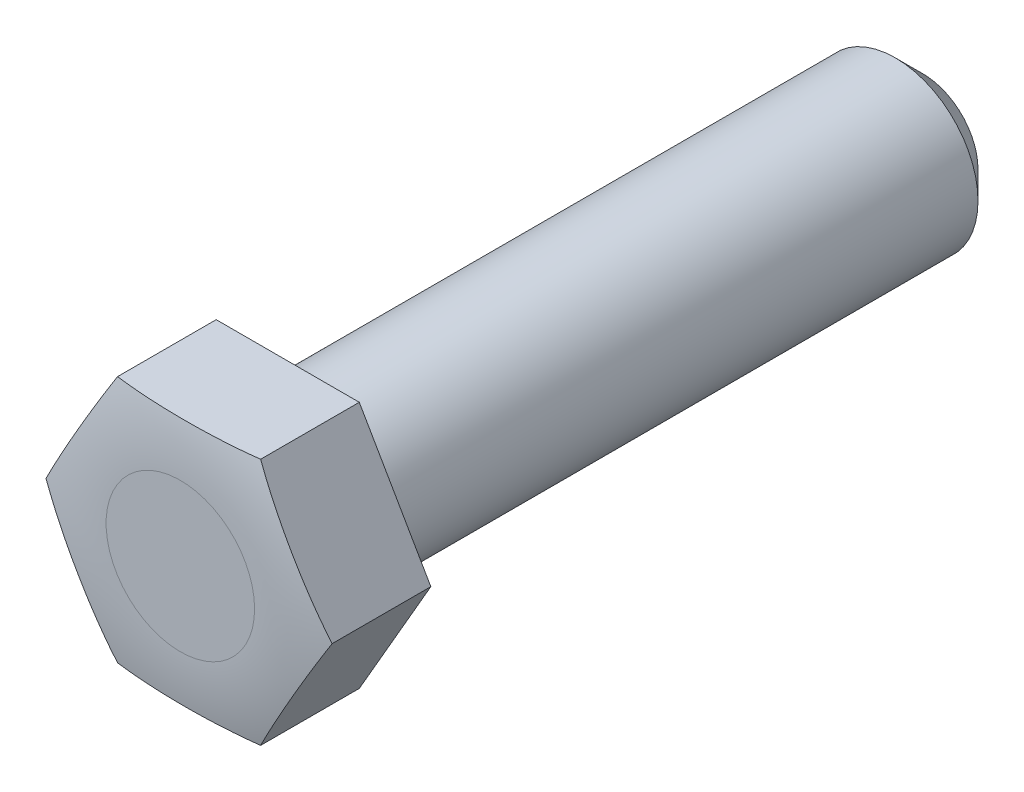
from build123d import *

# Parameters (mm, degrees)
EXTRUSION1_DEPTH      = 25.7
EXTRUSION1_DEPTH_BACK = 28.23212021
ESQUISSE1_R           = 6
EXTRUSION2_DEPTH      = 7.8
CHANFREIN1_SIZE       = 2


with BuildPart() as part:
    # Esquisse1 → Extrusion1 (new, two sides: drawn at the far end of the back side and taken through both)
    with BuildSketch(Plane.XY.offset(-EXTRUSION1_DEPTH_BACK)):
        with Locations((-67, 70)):
            Circle(ESQUISSE1_R)
    extrude(amount=EXTRUSION1_DEPTH + EXTRUSION1_DEPTH_BACK)

    # Esquisse2 → Extrusion2 (add)
    with BuildSketch(Plane.XY.offset(25.7)):
        Polygon((-56.607695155, 70), (-61.803847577, 79), (-72.196152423, 79), (-77.392304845, 70), (-72.196152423, 61), (-61.803847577, 61), align=None)
    extrude(amount=-EXTRUSION2_DEPTH)

    # Esquisse3 → Enl_vement de mati_re-R_volution5 (revolve, cut)
    with BuildSketch(Plane(origin=(-19.939110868, -11.511851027, 0), x_dir=(0, 0, -1), z_dir=(-0.8660254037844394, -0.4999999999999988, 0)), mode=Mode.PRIVATE) as enl_vement_de_mati_re_r_volution5_sk:
        with BuildLine():
            Line((-25.7, -88.729473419), (-34.524114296, -88.729473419))
            Line((-34.524114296, -88.729473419), (-34.524114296, -83.729473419))
            Line((-34.524114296, -83.729473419), (-25.7, -83.729473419))
            Line((-25.7, -83.729473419), (-25.064916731, -83.729473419))
            ThreePointArc((-25.064916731, -83.729473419), (-25.540593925, -86.20938757), (-25.7, -88.729473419))
        make_face()
    revolve(enl_vement_de_mati_re_r_volution5_sk.sketch.rotate(Axis((-67, 70, 17.9), (0, 0, -1)), 120), axis=Axis((-67, 70, 17.9), (0, 0, -1)), mode=Mode.SUBTRACT)

    # Chanfrein1
    chanfrein1_edges = [part.edges().sort_by_distance(p)[0] for p in [
        (-73, 70, -28.23212021),
    ]]
    chamfer(chanfrein1_edges, length=CHANFREIN1_SIZE)


solid = part.part
